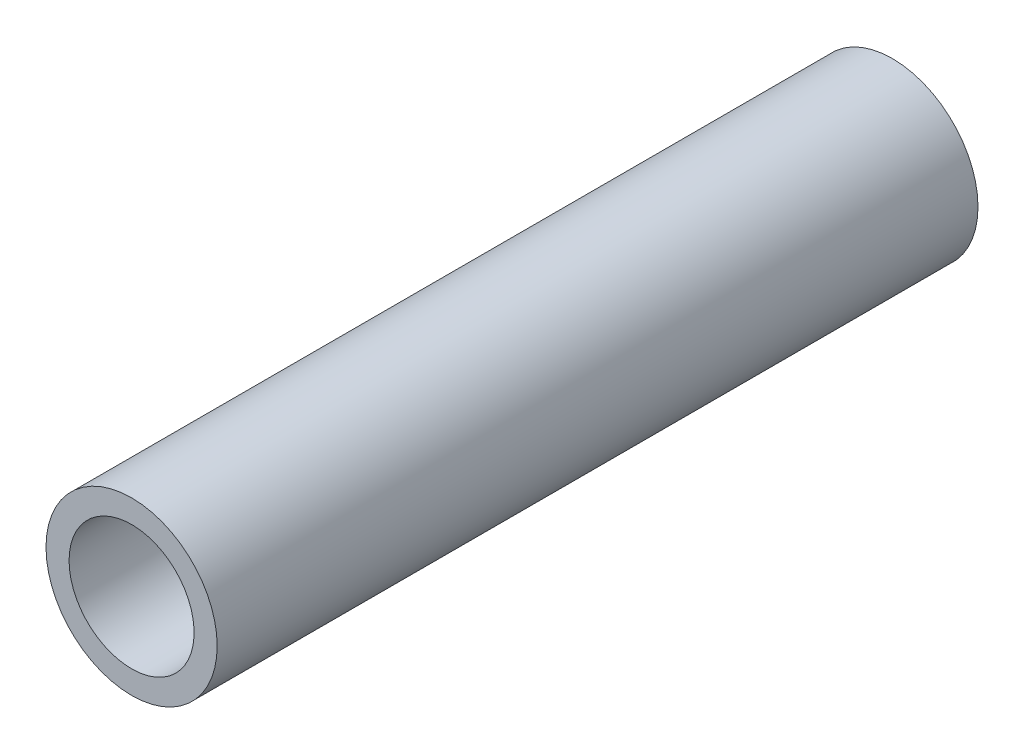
ISO-10303-21;
HEADER;
FILE_DESCRIPTION(('STEP AP214'),'2;1');
FILE_NAME('part.step','',(''),(''),'','','');
FILE_SCHEMA(('AUTOMOTIVE_DESIGN { 1 0 10303 214 1 1 1 1 }'));
ENDSEC;
DATA;
#1=APPLICATION_CONTEXT('core data for automotive mechanical design processes');
#2=APPLICATION_PROTOCOL_DEFINITION('international standard','automotive_design',2000,#1);
#3=PRODUCT_CONTEXT('',#1,'mechanical');
#4=PRODUCT('Part','Part','',(#3));
#5=PRODUCT_RELATED_PRODUCT_CATEGORY('part','',(#4));
#6=PRODUCT_DEFINITION_FORMATION('','',#4);
#7=PRODUCT_DEFINITION_CONTEXT('part definition',#1,'design');
#8=PRODUCT_DEFINITION('design','',#6,#7);
#9=PRODUCT_DEFINITION_SHAPE('','',#8);
#10=(LENGTH_UNIT() NAMED_UNIT(*) SI_UNIT(.MILLI.,.METRE.));
#11=(NAMED_UNIT(*) PLANE_ANGLE_UNIT() SI_UNIT($,.RADIAN.));
#12=(NAMED_UNIT(*) SI_UNIT($,.STERADIAN.) SOLID_ANGLE_UNIT());
#13=UNCERTAINTY_MEASURE_WITH_UNIT(LENGTH_MEASURE(1.E-05),#10,'distance_accuracy_value','');
#14=(GEOMETRIC_REPRESENTATION_CONTEXT(3) GLOBAL_UNCERTAINTY_ASSIGNED_CONTEXT((#13)) GLOBAL_UNIT_ASSIGNED_CONTEXT((#10,
#11,#12)) REPRESENTATION_CONTEXT('',''));
#15=CARTESIAN_POINT('',(0.,0.,0.));
#16=DIRECTION('',(0.,0.,1.));
#17=DIRECTION('',(1.,0.,0.));
#18=AXIS2_PLACEMENT_3D('',#15,#16,#17);
#19=CARTESIAN_POINT('',(0.,0.,76.2));
#20=DIRECTION('',(0.,0.,1.));
#21=DIRECTION('',(1.,0.,0.));
#22=AXIS2_PLACEMENT_3D('',#19,#20,#21);
#23=PLANE('',#22);
#24=CARTESIAN_POINT('',(0.,0.,76.2));
#25=DIRECTION('',(0.,0.,1.));
#26=DIRECTION('',(1.,0.,0.));
#27=AXIS2_PLACEMENT_3D('',#24,#25,#26);
#28=CIRCLE('',#27,8.5725);
#29=CARTESIAN_POINT('',(-8.5725,0.,76.2));
#30=VERTEX_POINT('',#29);
#31=EDGE_CURVE('E10',#30,#30,#28,.T.);
#32=ORIENTED_EDGE('',*,*,#31,.T.);
#33=EDGE_LOOP('',(#32));
#34=FACE_BOUND('',#33,.T.);
#35=CARTESIAN_POINT('',(0.,0.,76.2));
#36=DIRECTION('',(0.,0.,1.));
#37=DIRECTION('',(1.,0.,0.));
#38=AXIS2_PLACEMENT_3D('',#35,#36,#37);
#39=CIRCLE('',#38,6.2611);
#40=CARTESIAN_POINT('',(-6.2611,0.,76.2));
#41=VERTEX_POINT('',#40);
#42=EDGE_CURVE('E41',#41,#41,#39,.T.);
#43=ORIENTED_EDGE('',*,*,#42,.F.);
#44=EDGE_LOOP('',(#43));
#45=FACE_BOUND('',#44,.T.);
#46=ADVANCED_FACE('F30',(#34,#45),#23,.T.);
#47=CARTESIAN_POINT('',(0.,0.,0.));
#48=DIRECTION('',(0.,0.,1.));
#49=DIRECTION('',(1.,0.,0.));
#50=AXIS2_PLACEMENT_3D('',#47,#48,#49);
#51=PLANE('',#50);
#52=CARTESIAN_POINT('',(0.,0.,0.));
#53=DIRECTION('',(0.,0.,1.));
#54=DIRECTION('',(1.,0.,0.));
#55=AXIS2_PLACEMENT_3D('',#52,#53,#54);
#56=CIRCLE('',#55,8.5725);
#57=CARTESIAN_POINT('',(-8.5725,0.,0.));
#58=VERTEX_POINT('',#57);
#59=EDGE_CURVE('E34',#58,#58,#56,.T.);
#60=ORIENTED_EDGE('',*,*,#59,.F.);
#61=EDGE_LOOP('',(#60));
#62=FACE_BOUND('',#61,.T.);
#63=CARTESIAN_POINT('',(0.,0.,0.));
#64=DIRECTION('',(0.,0.,1.));
#65=DIRECTION('',(1.,0.,0.));
#66=AXIS2_PLACEMENT_3D('',#63,#64,#65);
#67=CIRCLE('',#66,6.2611);
#68=CARTESIAN_POINT('',(-6.2611,0.,0.));
#69=VERTEX_POINT('',#68);
#70=EDGE_CURVE('E43',#69,#69,#67,.T.);
#71=ORIENTED_EDGE('',*,*,#70,.T.);
#72=EDGE_LOOP('',(#71));
#73=FACE_BOUND('',#72,.T.);
#74=ADVANCED_FACE('F53',(#62,#73),#51,.F.);
#75=CARTESIAN_POINT('',(0.,0.,76.2));
#76=DIRECTION('',(0.,0.,-1.));
#77=DIRECTION('',(-1.,0.,0.));
#78=AXIS2_PLACEMENT_3D('',#75,#76,#77);
#79=CYLINDRICAL_SURFACE('',#78,8.5725);
#80=CARTESIAN_POINT('',(-8.5725,0.,76.2));
#81=CARTESIAN_POINT('',(-8.5725,0.,75.40625));
#82=CARTESIAN_POINT('',(-8.5725,0.,74.6125));
#83=CARTESIAN_POINT('',(-8.5725,0.,73.025));
#84=CARTESIAN_POINT('',(-8.5725,0.,72.23125));
#85=CARTESIAN_POINT('',(-8.5725,0.,70.64375));
#86=CARTESIAN_POINT('',(-8.5725,0.,69.85));
#87=CARTESIAN_POINT('',(-8.5725,0.,68.2625));
#88=CARTESIAN_POINT('',(-8.5725,0.,67.46875));
#89=CARTESIAN_POINT('',(-8.5725,0.,65.88125));
#90=CARTESIAN_POINT('',(-8.5725,0.,65.0875));
#91=CARTESIAN_POINT('',(-8.5725,0.,63.5));
#92=CARTESIAN_POINT('',(-8.5725,0.,62.70625));
#93=CARTESIAN_POINT('',(-8.5725,0.,61.11875));
#94=CARTESIAN_POINT('',(-8.5725,0.,60.325));
#95=CARTESIAN_POINT('',(-8.5725,0.,58.7375));
#96=CARTESIAN_POINT('',(-8.5725,0.,57.94375));
#97=CARTESIAN_POINT('',(-8.5725,0.,56.35625));
#98=CARTESIAN_POINT('',(-8.5725,0.,55.5625));
#99=CARTESIAN_POINT('',(-8.5725,0.,53.975));
#100=CARTESIAN_POINT('',(-8.5725,0.,53.18125));
#101=CARTESIAN_POINT('',(-8.5725,0.,51.59375));
#102=CARTESIAN_POINT('',(-8.5725,0.,50.8));
#103=CARTESIAN_POINT('',(-8.5725,0.,49.2125));
#104=CARTESIAN_POINT('',(-8.5725,0.,48.41875));
#105=CARTESIAN_POINT('',(-8.5725,0.,46.83125));
#106=CARTESIAN_POINT('',(-8.5725,0.,46.0375));
#107=CARTESIAN_POINT('',(-8.5725,0.,44.45));
#108=CARTESIAN_POINT('',(-8.5725,0.,43.65625));
#109=CARTESIAN_POINT('',(-8.5725,0.,42.06875));
#110=CARTESIAN_POINT('',(-8.5725,0.,41.275));
#111=CARTESIAN_POINT('',(-8.5725,0.,39.6875));
#112=CARTESIAN_POINT('',(-8.5725,0.,38.89375));
#113=CARTESIAN_POINT('',(-8.5725,0.,37.30625));
#114=CARTESIAN_POINT('',(-8.5725,0.,36.5125));
#115=CARTESIAN_POINT('',(-8.5725,0.,34.925));
#116=CARTESIAN_POINT('',(-8.5725,0.,34.13125));
#117=CARTESIAN_POINT('',(-8.5725,0.,32.54375));
#118=CARTESIAN_POINT('',(-8.5725,0.,31.75));
#119=CARTESIAN_POINT('',(-8.5725,0.,30.1625));
#120=CARTESIAN_POINT('',(-8.5725,0.,29.36875));
#121=CARTESIAN_POINT('',(-8.5725,0.,27.78125));
#122=CARTESIAN_POINT('',(-8.5725,0.,26.9875));
#123=CARTESIAN_POINT('',(-8.5725,0.,25.4));
#124=CARTESIAN_POINT('',(-8.5725,0.,24.60625));
#125=CARTESIAN_POINT('',(-8.5725,0.,23.01875));
#126=CARTESIAN_POINT('',(-8.5725,0.,22.225));
#127=CARTESIAN_POINT('',(-8.5725,0.,20.6375));
#128=CARTESIAN_POINT('',(-8.5725,0.,19.84375));
#129=CARTESIAN_POINT('',(-8.5725,0.,18.25625));
#130=CARTESIAN_POINT('',(-8.5725,0.,17.4625));
#131=CARTESIAN_POINT('',(-8.5725,0.,15.875));
#132=CARTESIAN_POINT('',(-8.5725,0.,15.08125));
#133=CARTESIAN_POINT('',(-8.5725,0.,13.49375));
#134=CARTESIAN_POINT('',(-8.5725,0.,12.7));
#135=CARTESIAN_POINT('',(-8.5725,0.,11.1125));
#136=CARTESIAN_POINT('',(-8.5725,0.,10.31875));
#137=CARTESIAN_POINT('',(-8.5725,0.,8.73125));
#138=CARTESIAN_POINT('',(-8.5725,0.,7.93750000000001));
#139=CARTESIAN_POINT('',(-8.5725,0.,6.35));
#140=CARTESIAN_POINT('',(-8.5725,0.,5.55625));
#141=CARTESIAN_POINT('',(-8.5725,0.,3.96875));
#142=CARTESIAN_POINT('',(-8.5725,0.,3.175));
#143=CARTESIAN_POINT('',(-8.5725,0.,1.5875));
#144=CARTESIAN_POINT('',(-8.5725,0.,0.793750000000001));
#145=CARTESIAN_POINT('',(-8.5725,0.,0.));
#146=B_SPLINE_CURVE_WITH_KNOTS('',3,(#80,#81,#82,#83,#84,#85,#86,#87,#88,#89,#90,#91,#92,#93,
#94,#95,#96,#97,#98,#99,#100,#101,#102,#103,#104,#105,#106,#107,#108,#109,#110,#111,#112,#113,
#114,#115,#116,#117,#118,#119,#120,#121,#122,#123,#124,#125,#126,#127,#128,#129,#130,#131,#132,
#133,#134,#135,#136,#137,#138,#139,#140,#141,#142,#143,#144,#145),.UNSPECIFIED.,.F.,.F.,(4,2,2,
2,2,2,2,2,2,2,2,2,2,2,2,2,2,2,2,2,2,2,2,2,2,2,2,2,2,2,2,2,4),(0.,2.38125,4.7625,7.14375,
9.52500000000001,11.90625,14.2875,16.66875,19.05,21.43125,23.8125,26.19375,28.575,30.95625,
33.3375,35.71875,38.1,40.48125,42.8625,45.24375,47.625,50.00625,52.3875,54.76875,57.15,59.53125,
61.9125,64.29375,66.675,69.05625,71.4375,73.81875,76.2),.UNSPECIFIED.);
#147=EDGE_CURVE('BSEAM32',#30,#58,#146,.T.);
#148=ORIENTED_EDGE('',*,*,#31,.F.);
#149=ORIENTED_EDGE('',*,*,#59,.T.);
#150=ORIENTED_EDGE('',*,*,#147,.T.);
#151=ORIENTED_EDGE('',*,*,#147,.F.);
#152=EDGE_LOOP('',(#148,#150,#149,#151));
#153=FACE_BOUND('',#152,.T.);
#154=ADVANCED_FACE('F32',(#153),#79,.T.);
#155=CARTESIAN_POINT('',(0.,0.,76.2));
#156=DIRECTION('',(0.,0.,-1.));
#157=DIRECTION('',(-1.,0.,0.));
#158=AXIS2_PLACEMENT_3D('',#155,#156,#157);
#159=CYLINDRICAL_SURFACE('',#158,6.2611);
#160=CARTESIAN_POINT('',(-6.2611,0.,76.2));
#161=CARTESIAN_POINT('',(-6.2611,0.,75.40625));
#162=CARTESIAN_POINT('',(-6.2611,0.,74.6125));
#163=CARTESIAN_POINT('',(-6.2611,0.,73.025));
#164=CARTESIAN_POINT('',(-6.2611,0.,72.23125));
#165=CARTESIAN_POINT('',(-6.2611,0.,70.64375));
#166=CARTESIAN_POINT('',(-6.2611,0.,69.85));
#167=CARTESIAN_POINT('',(-6.2611,0.,68.2625));
#168=CARTESIAN_POINT('',(-6.2611,0.,67.46875));
#169=CARTESIAN_POINT('',(-6.2611,0.,65.88125));
#170=CARTESIAN_POINT('',(-6.2611,0.,65.0875));
#171=CARTESIAN_POINT('',(-6.2611,0.,63.5));
#172=CARTESIAN_POINT('',(-6.2611,0.,62.70625));
#173=CARTESIAN_POINT('',(-6.2611,0.,61.11875));
#174=CARTESIAN_POINT('',(-6.2611,0.,60.325));
#175=CARTESIAN_POINT('',(-6.2611,0.,58.7375));
#176=CARTESIAN_POINT('',(-6.2611,0.,57.94375));
#177=CARTESIAN_POINT('',(-6.2611,0.,56.35625));
#178=CARTESIAN_POINT('',(-6.2611,0.,55.5625));
#179=CARTESIAN_POINT('',(-6.2611,0.,53.975));
#180=CARTESIAN_POINT('',(-6.2611,0.,53.18125));
#181=CARTESIAN_POINT('',(-6.2611,0.,51.59375));
#182=CARTESIAN_POINT('',(-6.2611,0.,50.8));
#183=CARTESIAN_POINT('',(-6.2611,0.,49.2125));
#184=CARTESIAN_POINT('',(-6.2611,0.,48.41875));
#185=CARTESIAN_POINT('',(-6.2611,0.,46.83125));
#186=CARTESIAN_POINT('',(-6.2611,0.,46.0375));
#187=CARTESIAN_POINT('',(-6.2611,0.,44.45));
#188=CARTESIAN_POINT('',(-6.2611,0.,43.65625));
#189=CARTESIAN_POINT('',(-6.2611,0.,42.06875));
#190=CARTESIAN_POINT('',(-6.2611,0.,41.275));
#191=CARTESIAN_POINT('',(-6.2611,0.,39.6875));
#192=CARTESIAN_POINT('',(-6.2611,0.,38.89375));
#193=CARTESIAN_POINT('',(-6.2611,0.,37.30625));
#194=CARTESIAN_POINT('',(-6.2611,0.,36.5125));
#195=CARTESIAN_POINT('',(-6.2611,0.,34.925));
#196=CARTESIAN_POINT('',(-6.2611,0.,34.13125));
#197=CARTESIAN_POINT('',(-6.2611,0.,32.54375));
#198=CARTESIAN_POINT('',(-6.2611,0.,31.75));
#199=CARTESIAN_POINT('',(-6.2611,0.,30.1625));
#200=CARTESIAN_POINT('',(-6.2611,0.,29.36875));
#201=CARTESIAN_POINT('',(-6.2611,0.,27.78125));
#202=CARTESIAN_POINT('',(-6.2611,0.,26.9875));
#203=CARTESIAN_POINT('',(-6.2611,0.,25.4));
#204=CARTESIAN_POINT('',(-6.2611,0.,24.60625));
#205=CARTESIAN_POINT('',(-6.2611,0.,23.01875));
#206=CARTESIAN_POINT('',(-6.2611,0.,22.225));
#207=CARTESIAN_POINT('',(-6.2611,0.,20.6375));
#208=CARTESIAN_POINT('',(-6.2611,0.,19.84375));
#209=CARTESIAN_POINT('',(-6.2611,0.,18.25625));
#210=CARTESIAN_POINT('',(-6.2611,0.,17.4625));
#211=CARTESIAN_POINT('',(-6.2611,0.,15.875));
#212=CARTESIAN_POINT('',(-6.2611,0.,15.08125));
#213=CARTESIAN_POINT('',(-6.2611,0.,13.49375));
#214=CARTESIAN_POINT('',(-6.2611,0.,12.7));
#215=CARTESIAN_POINT('',(-6.2611,0.,11.1125));
#216=CARTESIAN_POINT('',(-6.2611,0.,10.31875));
#217=CARTESIAN_POINT('',(-6.2611,0.,8.73125));
#218=CARTESIAN_POINT('',(-6.2611,0.,7.93750000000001));
#219=CARTESIAN_POINT('',(-6.2611,0.,6.35));
#220=CARTESIAN_POINT('',(-6.2611,0.,5.55625));
#221=CARTESIAN_POINT('',(-6.2611,0.,3.96875));
#222=CARTESIAN_POINT('',(-6.2611,0.,3.175));
#223=CARTESIAN_POINT('',(-6.2611,0.,1.5875));
#224=CARTESIAN_POINT('',(-6.2611,0.,0.793750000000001));
#225=CARTESIAN_POINT('',(-6.2611,0.,0.));
#226=B_SPLINE_CURVE_WITH_KNOTS('',3,(#160,#161,#162,#163,#164,#165,#166,#167,#168,#169,#170,
#171,#172,#173,#174,#175,#176,#177,#178,#179,#180,#181,#182,#183,#184,#185,#186,#187,#188,#189,
#190,#191,#192,#193,#194,#195,#196,#197,#198,#199,#200,#201,#202,#203,#204,#205,#206,#207,#208,
#209,#210,#211,#212,#213,#214,#215,#216,#217,#218,#219,#220,#221,#222,#223,#224,#225),
.UNSPECIFIED.,.F.,.F.,(4,2,2,2,2,2,2,2,2,2,2,2,2,2,2,2,2,2,2,2,2,2,2,2,2,2,2,2,2,2,2,2,4),(0.,
2.38124999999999,4.76249999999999,7.14374999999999,9.52499999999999,11.90625,14.2875,16.66875,
19.05,21.43125,23.8125,26.19375,28.575,30.95625,33.3375,35.71875,38.1,40.48125,42.8625,45.24375,
47.625,50.00625,52.3875,54.76875,57.15,59.53125,61.9125,64.29375,66.675,69.05625,71.4375,
73.81875,76.2),.UNSPECIFIED.);
#227=EDGE_CURVE('BSEAM49',#41,#69,#226,.T.);
#228=ORIENTED_EDGE('',*,*,#42,.T.);
#229=ORIENTED_EDGE('',*,*,#70,.F.);
#230=ORIENTED_EDGE('',*,*,#227,.T.);
#231=ORIENTED_EDGE('',*,*,#227,.F.);
#232=EDGE_LOOP('',(#228,#230,#229,#231));
#233=FACE_BOUND('',#232,.T.);
#234=ADVANCED_FACE('F49',(#233),#159,.F.);
#235=CLOSED_SHELL('',(#46,#74,#154,#234));
#236=MANIFOLD_SOLID_BREP('B2',#235);
#237=ADVANCED_BREP_SHAPE_REPRESENTATION('',(#18,#236),#14);
#238=SHAPE_DEFINITION_REPRESENTATION(#9,#237);
ENDSEC;
END-ISO-10303-21;
